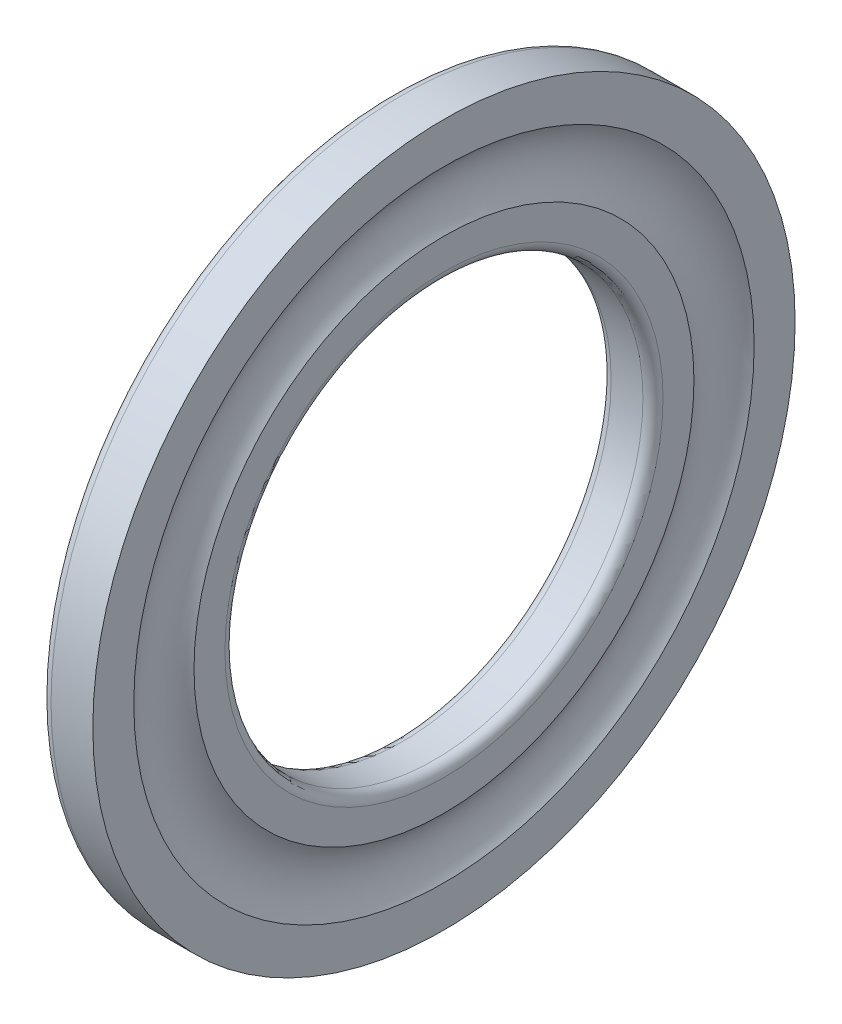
ISO-10303-21;
HEADER;
FILE_DESCRIPTION(('STEP AP214'),'2;1');
FILE_NAME('part.step','',(''),(''),'','','');
FILE_SCHEMA(('AUTOMOTIVE_DESIGN { 1 0 10303 214 1 1 1 1 }'));
ENDSEC;
DATA;
#1=APPLICATION_CONTEXT('core data for automotive mechanical design processes');
#2=APPLICATION_PROTOCOL_DEFINITION('international standard','automotive_design',2000,#1);
#3=PRODUCT_CONTEXT('',#1,'mechanical');
#4=PRODUCT('Part','Part','',(#3));
#5=PRODUCT_RELATED_PRODUCT_CATEGORY('part','',(#4));
#6=PRODUCT_DEFINITION_FORMATION('','',#4);
#7=PRODUCT_DEFINITION_CONTEXT('part definition',#1,'design');
#8=PRODUCT_DEFINITION('design','',#6,#7);
#9=PRODUCT_DEFINITION_SHAPE('','',#8);
#10=(LENGTH_UNIT() NAMED_UNIT(*) SI_UNIT(.MILLI.,.METRE.));
#11=(NAMED_UNIT(*) PLANE_ANGLE_UNIT() SI_UNIT($,.RADIAN.));
#12=(NAMED_UNIT(*) SI_UNIT($,.STERADIAN.) SOLID_ANGLE_UNIT());
#13=UNCERTAINTY_MEASURE_WITH_UNIT(LENGTH_MEASURE(1.E-05),#10,'distance_accuracy_value','');
#14=(GEOMETRIC_REPRESENTATION_CONTEXT(3) GLOBAL_UNCERTAINTY_ASSIGNED_CONTEXT((#13)) GLOBAL_UNIT_ASSIGNED_CONTEXT((#10,
#11,#12)) REPRESENTATION_CONTEXT('',''));
#15=CARTESIAN_POINT('',(0.,0.,0.));
#16=DIRECTION('',(0.,0.,1.));
#17=DIRECTION('',(1.,0.,0.));
#18=AXIS2_PLACEMENT_3D('',#15,#16,#17);
#19=CARTESIAN_POINT('',(0.,-20.7789574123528,-20.4));
#20=DIRECTION('',(-1.,0.,0.));
#21=DIRECTION('',(0.,0.,1.));
#22=AXIS2_PLACEMENT_3D('',#19,#20,#21);
#23=PLANE('',#22);
#24=CARTESIAN_POINT('',(0.,0.,0.));
#25=DIRECTION('',(-1.,0.,0.));
#26=DIRECTION('',(0.,0.,-1.));
#27=AXIS2_PLACEMENT_3D('',#24,#25,#26);
#28=CIRCLE('',#27,20.4);
#29=CARTESIAN_POINT('',(0.,0.,-20.4));
#30=VERTEX_POINT('',#29);
#31=EDGE_CURVE('E47',#30,#30,#28,.F.);
#32=ORIENTED_EDGE('',*,*,#31,.F.);
#33=EDGE_LOOP('',(#32));
#34=FACE_BOUND('',#33,.T.);
#35=CARTESIAN_POINT('',(0.,0.,0.));
#36=DIRECTION('',(1.,0.,0.));
#37=DIRECTION('',(0.,0.,1.));
#38=AXIS2_PLACEMENT_3D('',#35,#36,#37);
#39=CIRCLE('',#38,13.1000000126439);
#40=CARTESIAN_POINT('',(0.,0.,13.1000000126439));
#41=VERTEX_POINT('',#40);
#42=EDGE_CURVE('E44',#41,#41,#39,.T.);
#43=ORIENTED_EDGE('',*,*,#42,.T.);
#44=EDGE_LOOP('',(#43));
#45=FACE_BOUND('',#44,.T.);
#46=ADVANCED_FACE('F15',(#34,#45),#23,.T.);
#47=CARTESIAN_POINT('',(3.1,-15.2277163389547,14.95));
#48=DIRECTION('',(1.,0.,0.));
#49=DIRECTION('',(0.,0.,-1.));
#50=AXIS2_PLACEMENT_3D('',#47,#48,#49);
#51=PLANE('',#50);
#52=CARTESIAN_POINT('',(3.1,0.,0.));
#53=DIRECTION('',(1.,0.,0.));
#54=DIRECTION('',(0.,0.,1.));
#55=AXIS2_PLACEMENT_3D('',#52,#53,#54);
#56=CIRCLE('',#55,14.95);
#57=CARTESIAN_POINT('',(3.1,0.,14.95));
#58=VERTEX_POINT('',#57);
#59=EDGE_CURVE('E41',#58,#58,#56,.T.);
#60=ORIENTED_EDGE('',*,*,#59,.T.);
#61=EDGE_LOOP('',(#60));
#62=FACE_BOUND('',#61,.T.);
#63=CARTESIAN_POINT('',(3.1,0.,0.));
#64=DIRECTION('',(-1.,0.,0.));
#65=DIRECTION('',(0.,0.,-1.));
#66=AXIS2_PLACEMENT_3D('',#63,#64,#65);
#67=CIRCLE('',#66,13.1);
#68=CARTESIAN_POINT('',(3.1,0.,-13.1));
#69=VERTEX_POINT('',#68);
#70=EDGE_CURVE('E38',#69,#69,#67,.F.);
#71=ORIENTED_EDGE('',*,*,#70,.F.);
#72=EDGE_LOOP('',(#71));
#73=FACE_BOUND('',#72,.T.);
#74=ADVANCED_FACE('F55',(#62,#73),#51,.T.);
#75=CARTESIAN_POINT('',(3.1,-21.3901031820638,21.));
#76=DIRECTION('',(1.,0.,0.));
#77=DIRECTION('',(0.,0.,-1.));
#78=AXIS2_PLACEMENT_3D('',#75,#76,#77);
#79=PLANE('',#78);
#80=CARTESIAN_POINT('',(3.1,0.,0.));
#81=DIRECTION('',(1.,0.,0.));
#82=DIRECTION('',(0.,-1.16847856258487E-09,1.));
#83=AXIS2_PLACEMENT_3D('',#80,#81,#82);
#84=CIRCLE('',#83,21.);
#85=CARTESIAN_POINT('',(3.1,-2.45380498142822E-08,21.));
#86=VERTEX_POINT('',#85);
#87=EDGE_CURVE('E35',#86,#86,#84,.T.);
#88=ORIENTED_EDGE('',*,*,#87,.T.);
#89=EDGE_LOOP('',(#88));
#90=FACE_BOUND('',#89,.T.);
#91=CARTESIAN_POINT('',(3.1,0.,0.));
#92=DIRECTION('',(-1.,0.,0.));
#93=DIRECTION('',(0.,0.,-1.));
#94=AXIS2_PLACEMENT_3D('',#91,#92,#93);
#95=CIRCLE('',#94,18.55);
#96=CARTESIAN_POINT('',(3.1,0.,-18.55));
#97=VERTEX_POINT('',#96);
#98=EDGE_CURVE('E30',#97,#97,#95,.F.);
#99=ORIENTED_EDGE('',*,*,#98,.F.);
#100=EDGE_LOOP('',(#99));
#101=FACE_BOUND('',#100,.T.);
#102=ADVANCED_FACE('F62',(#90,#101),#79,.T.);
#103=CARTESIAN_POINT('',(0.599999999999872,0.,0.));
#104=DIRECTION('',(1.,0.,0.));
#105=DIRECTION('',(0.,0.,1.));
#106=AXIS2_PLACEMENT_3D('',#103,#104,#105);
#107=TOROIDAL_SURFACE('',#106,13.0999999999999,0.599999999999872);
#108=CARTESIAN_POINT('',(0.6,0.,0.));
#109=DIRECTION('',(1.,0.,0.));
#110=DIRECTION('',(0.,0.,1.));
#111=AXIS2_PLACEMENT_3D('',#108,#109,#110);
#112=CIRCLE('',#111,12.5);
#113=CARTESIAN_POINT('',(0.6,0.,12.5));
#114=VERTEX_POINT('',#113);
#115=EDGE_CURVE('E26',#114,#114,#112,.T.);
#116=ORIENTED_EDGE('',*,*,#115,.T.);
#117=EDGE_LOOP('',(#116));
#118=FACE_BOUND('',#117,.T.);
#119=ORIENTED_EDGE('',*,*,#42,.F.);
#120=EDGE_LOOP('',(#119));
#121=FACE_BOUND('',#120,.T.);
#122=ADVANCED_FACE('F59',(#118,#121),#107,.T.);
#123=CARTESIAN_POINT('',(3.1,0.,0.));
#124=DIRECTION('',(1.,0.,0.));
#125=DIRECTION('',(0.,0.,1.));
#126=AXIS2_PLACEMENT_3D('',#123,#124,#125);
#127=CYLINDRICAL_SURFACE('',#126,12.5);
#128=CARTESIAN_POINT('',(2.5,0.,0.));
#129=DIRECTION('',(1.,0.,0.));
#130=DIRECTION('',(0.,0.,1.));
#131=AXIS2_PLACEMENT_3D('',#128,#129,#130);
#132=CIRCLE('',#131,12.5);
#133=CARTESIAN_POINT('',(2.5,0.,12.5));
#134=VERTEX_POINT('',#133);
#135=EDGE_CURVE('E22',#134,#134,#132,.T.);
#136=ORIENTED_EDGE('',*,*,#135,.T.);
#137=EDGE_LOOP('',(#136));
#138=FACE_BOUND('',#137,.T.);
#139=ORIENTED_EDGE('',*,*,#115,.F.);
#140=EDGE_LOOP('',(#139));
#141=FACE_BOUND('',#140,.T.);
#142=ADVANCED_FACE('F61',(#138,#141),#127,.F.);
#143=CARTESIAN_POINT('',(2.50000000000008,0.,0.));
#144=DIRECTION('',(1.,0.,0.));
#145=DIRECTION('',(0.,0.,1.));
#146=AXIS2_PLACEMENT_3D('',#143,#144,#145);
#147=TOROIDAL_SURFACE('',#146,13.1,0.599999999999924);
#148=ORIENTED_EDGE('',*,*,#70,.T.);
#149=EDGE_LOOP('',(#148));
#150=FACE_BOUND('',#149,.T.);
#151=ORIENTED_EDGE('',*,*,#135,.F.);
#152=EDGE_LOOP('',(#151));
#153=FACE_BOUND('',#152,.T.);
#154=ADVANCED_FACE('F70',(#150,#153),#147,.T.);
#155=CARTESIAN_POINT('',(5.5,0.,0.));
#156=DIRECTION('',(1.,0.,0.));
#157=DIRECTION('',(0.,0.,1.));
#158=AXIS2_PLACEMENT_3D('',#155,#156,#157);
#159=TOROIDAL_SURFACE('',#158,16.75,3.);
#160=ORIENTED_EDGE('',*,*,#59,.F.);
#161=EDGE_LOOP('',(#160));
#162=FACE_BOUND('',#161,.T.);
#163=ORIENTED_EDGE('',*,*,#98,.T.);
#164=EDGE_LOOP('',(#163));
#165=FACE_BOUND('',#164,.T.);
#166=ADVANCED_FACE('F78',(#162,#165),#159,.F.);
#167=CARTESIAN_POINT('',(3.1,0.,0.));
#168=DIRECTION('',(1.,0.,0.));
#169=DIRECTION('',(0.,0.,1.));
#170=AXIS2_PLACEMENT_3D('',#167,#168,#169);
#171=CYLINDRICAL_SURFACE('',#170,21.);
#172=CARTESIAN_POINT('',(0.6,0.,0.));
#173=DIRECTION('',(1.,0.,0.));
#174=DIRECTION('',(0.,0.,1.));
#175=AXIS2_PLACEMENT_3D('',#172,#173,#174);
#176=CIRCLE('',#175,21.);
#177=CARTESIAN_POINT('',(0.6,0.,21.));
#178=VERTEX_POINT('',#177);
#179=EDGE_CURVE('E10',#178,#178,#176,.T.);
#180=ORIENTED_EDGE('',*,*,#179,.T.);
#181=EDGE_LOOP('',(#180));
#182=FACE_BOUND('',#181,.T.);
#183=ORIENTED_EDGE('',*,*,#87,.F.);
#184=EDGE_LOOP('',(#183));
#185=FACE_BOUND('',#184,.T.);
#186=ADVANCED_FACE('F81',(#182,#185),#171,.T.);
#187=CARTESIAN_POINT('',(0.599999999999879,0.,0.));
#188=DIRECTION('',(1.,0.,0.));
#189=DIRECTION('',(0.,0.,1.));
#190=AXIS2_PLACEMENT_3D('',#187,#188,#189);
#191=TOROIDAL_SURFACE('',#190,20.4,0.599999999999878);
#192=ORIENTED_EDGE('',*,*,#31,.T.);
#193=EDGE_LOOP('',(#192));
#194=FACE_BOUND('',#193,.T.);
#195=ORIENTED_EDGE('',*,*,#179,.F.);
#196=EDGE_LOOP('',(#195));
#197=FACE_BOUND('',#196,.T.);
#198=ADVANCED_FACE('F17',(#194,#197),#191,.T.);
#199=CLOSED_SHELL('',(#46,#74,#102,#122,#142,#154,#166,#186,#198));
#200=MANIFOLD_SOLID_BREP('B1',#199);
#201=ADVANCED_BREP_SHAPE_REPRESENTATION('',(#18,#200),#14);
#202=SHAPE_DEFINITION_REPRESENTATION(#9,#201);
ENDSEC;
END-ISO-10303-21;
